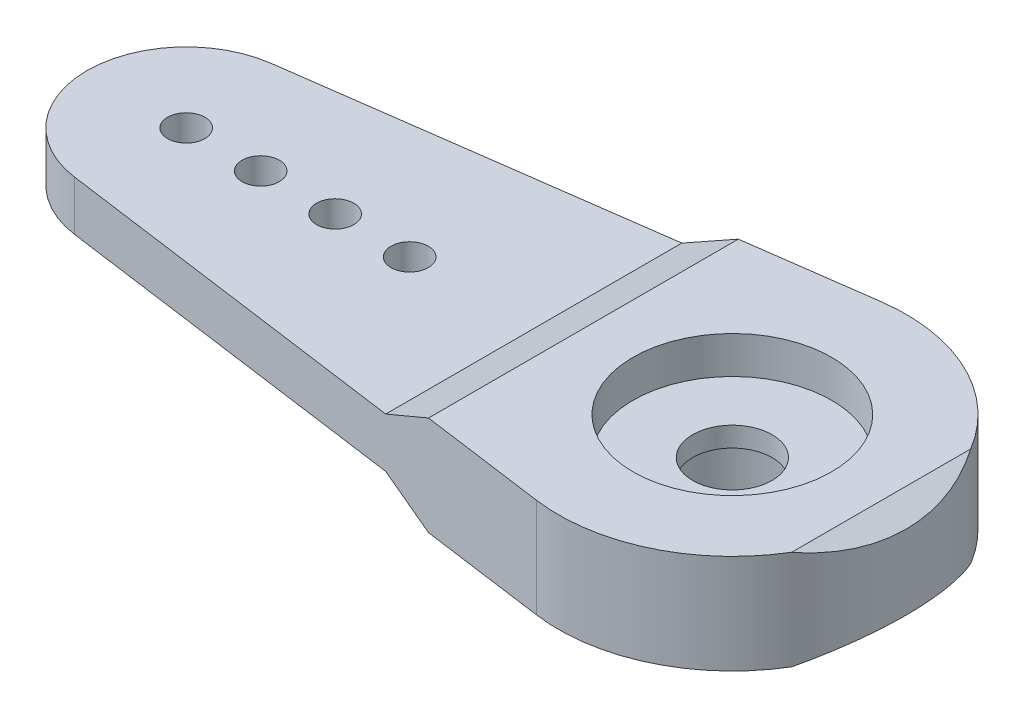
ISO-10303-21;
HEADER;
FILE_DESCRIPTION(('STEP AP214'),'2;1');
FILE_NAME('part.step','',(''),(''),'','','');
FILE_SCHEMA(('AUTOMOTIVE_DESIGN { 1 0 10303 214 1 1 1 1 }'));
ENDSEC;
DATA;
#1=APPLICATION_CONTEXT('core data for automotive mechanical design processes');
#2=APPLICATION_PROTOCOL_DEFINITION('international standard','automotive_design',2000,#1);
#3=PRODUCT_CONTEXT('',#1,'mechanical');
#4=PRODUCT('Part','Part','',(#3));
#5=PRODUCT_RELATED_PRODUCT_CATEGORY('part','',(#4));
#6=PRODUCT_DEFINITION_FORMATION('','',#4);
#7=PRODUCT_DEFINITION_CONTEXT('part definition',#1,'design');
#8=PRODUCT_DEFINITION('design','',#6,#7);
#9=PRODUCT_DEFINITION_SHAPE('','',#8);
#10=(LENGTH_UNIT() NAMED_UNIT(*) SI_UNIT(.MILLI.,.METRE.));
#11=(NAMED_UNIT(*) PLANE_ANGLE_UNIT() SI_UNIT($,.RADIAN.));
#12=(NAMED_UNIT(*) SI_UNIT($,.STERADIAN.) SOLID_ANGLE_UNIT());
#13=UNCERTAINTY_MEASURE_WITH_UNIT(LENGTH_MEASURE(1.E-05),#10,'distance_accuracy_value','');
#14=(GEOMETRIC_REPRESENTATION_CONTEXT(3) GLOBAL_UNCERTAINTY_ASSIGNED_CONTEXT((#13)) GLOBAL_UNIT_ASSIGNED_CONTEXT((#10,
#11,#12)) REPRESENTATION_CONTEXT('',''));
#15=CARTESIAN_POINT('',(0.,0.,0.));
#16=DIRECTION('',(0.,0.,1.));
#17=DIRECTION('',(1.,0.,0.));
#18=AXIS2_PLACEMENT_3D('',#15,#16,#17);
#19=CARTESIAN_POINT('',(-6.,0.,15.));
#20=DIRECTION('',(0.,1.,0.));
#21=DIRECTION('',(0.,0.,1.));
#22=AXIS2_PLACEMENT_3D('',#19,#20,#21);
#23=PLANE('',#22);
#24=DIRECTION('',(-0.990658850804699,0.,0.136363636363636));
#25=VECTOR('',#24,1.);
#26=CARTESIAN_POINT('',(-22.5454545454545,0.,-3.96263540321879));
#27=LINE('',#26,#25);
#28=CARTESIAN_POINT('',(-0.954545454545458,0.,-6.93461195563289));
#29=VERTEX_POINT('',#28);
#30=CARTESIAN_POINT('',(-6.,0.,-6.24010796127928));
#31=VERTEX_POINT('',#30);
#32=EDGE_CURVE('E125',#29,#31,#27,.T.);
#33=ORIENTED_EDGE('',*,*,#32,.F.);
#34=CARTESIAN_POINT('',(0.,0.,0.));
#35=DIRECTION('',(0.,1.,0.));
#36=DIRECTION('',(0.,0.,1.));
#37=AXIS2_PLACEMENT_3D('',#34,#35,#36);
#38=CIRCLE('',#37,7.);
#39=CARTESIAN_POINT('',(6.,0.,-3.60555127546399));
#40=VERTEX_POINT('',#39);
#41=EDGE_CURVE('E111',#40,#29,#38,.T.);
#42=ORIENTED_EDGE('',*,*,#41,.F.);
#43=DIRECTION('',(0.,0.,-1.));
#44=VECTOR('',#43,1.);
#45=CARTESIAN_POINT('',(6.,0.,15.));
#46=LINE('',#45,#44);
#47=CARTESIAN_POINT('',(6.,0.,3.60555127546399));
#48=VERTEX_POINT('',#47);
#49=EDGE_CURVE('E181',#48,#40,#46,.T.);
#50=ORIENTED_EDGE('',*,*,#49,.F.);
#51=CARTESIAN_POINT('',(-0.954545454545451,0.,6.93461195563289));
#52=VERTEX_POINT('',#51);
#53=EDGE_CURVE('E51',#52,#48,#38,.T.);
#54=ORIENTED_EDGE('',*,*,#53,.F.);
#55=DIRECTION('',(0.990658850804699,0.,0.136363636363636));
#56=VECTOR('',#55,1.);
#57=CARTESIAN_POINT('',(-0.954545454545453,0.,6.93461195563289));
#58=LINE('',#57,#56);
#59=CARTESIAN_POINT('',(-6.,0.,6.24010796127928));
#60=VERTEX_POINT('',#59);
#61=EDGE_CURVE('E121',#60,#52,#58,.T.);
#62=ORIENTED_EDGE('',*,*,#61,.F.);
#63=DIRECTION('',(0.,0.,-1.));
#64=VECTOR('',#63,1.);
#65=CARTESIAN_POINT('',(-6.,0.,15.));
#66=LINE('',#65,#64);
#67=EDGE_CURVE('E137',#60,#31,#66,.T.);
#68=ORIENTED_EDGE('',*,*,#67,.T.);
#69=EDGE_LOOP('',(#33,#42,#50,#54,#62,#68));
#70=FACE_BOUND('',#69,.T.);
#71=CARTESIAN_POINT('',(0.,0.,0.));
#72=DIRECTION('',(0.,1.,0.));
#73=DIRECTION('',(0.,0.,1.));
#74=AXIS2_PLACEMENT_3D('',#71,#72,#73);
#75=CIRCLE('',#74,5.);
#76=CARTESIAN_POINT('',(0.,0.,5.00000000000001));
#77=VERTEX_POINT('',#76);
#78=EDGE_CURVE('E11',#77,#77,#75,.F.);
#79=ORIENTED_EDGE('',*,*,#78,.F.);
#80=EDGE_LOOP('',(#79));
#81=FACE_BOUND('',#80,.T.);
#82=ADVANCED_FACE('F34',(#70,#81),#23,.F.);
#83=CARTESIAN_POINT('',(-6.,4.,15.));
#84=DIRECTION('',(0.,-1.,0.));
#85=DIRECTION('',(0.,0.,-1.));
#86=AXIS2_PLACEMENT_3D('',#83,#84,#85);
#87=PLANE('',#86);
#88=CARTESIAN_POINT('',(0.,4.,0.));
#89=DIRECTION('',(0.,1.,0.));
#90=DIRECTION('',(0.,0.,1.));
#91=AXIS2_PLACEMENT_3D('',#88,#89,#90);
#92=CIRCLE('',#91,4.);
#93=CARTESIAN_POINT('',(0.,4.,4.));
#94=VERTEX_POINT('',#93);
#95=EDGE_CURVE('E229',#94,#94,#92,.T.);
#96=ORIENTED_EDGE('',*,*,#95,.F.);
#97=EDGE_LOOP('',(#96));
#98=FACE_BOUND('',#97,.T.);
#99=DIRECTION('',(-0.990658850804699,0.,0.136363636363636));
#100=VECTOR('',#99,1.);
#101=CARTESIAN_POINT('',(-22.5454545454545,4.,-3.96263540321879));
#102=LINE('',#101,#100);
#103=CARTESIAN_POINT('',(-0.954545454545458,4.,-6.93461195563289));
#104=VERTEX_POINT('',#103);
#105=CARTESIAN_POINT('',(-6.,4.,-6.24010796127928));
#106=VERTEX_POINT('',#105);
#107=EDGE_CURVE('E128',#104,#106,#102,.T.);
#108=ORIENTED_EDGE('',*,*,#107,.T.);
#109=DIRECTION('',(0.,0.,-1.));
#110=VECTOR('',#109,1.);
#111=CARTESIAN_POINT('',(-6.,4.,15.));
#112=LINE('',#111,#110);
#113=CARTESIAN_POINT('',(-6.,4.,6.24010796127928));
#114=VERTEX_POINT('',#113);
#115=EDGE_CURVE('E175',#114,#106,#112,.T.);
#116=ORIENTED_EDGE('',*,*,#115,.F.);
#117=DIRECTION('',(0.990658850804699,0.,0.136363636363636));
#118=VECTOR('',#117,1.);
#119=CARTESIAN_POINT('',(-0.954545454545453,4.,6.93461195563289));
#120=LINE('',#119,#118);
#121=CARTESIAN_POINT('',(-0.954545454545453,4.,6.93461195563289));
#122=VERTEX_POINT('',#121);
#123=EDGE_CURVE('E144',#114,#122,#120,.T.);
#124=ORIENTED_EDGE('',*,*,#123,.T.);
#125=CARTESIAN_POINT('',(0.,4.,0.));
#126=DIRECTION('',(0.,1.,0.));
#127=DIRECTION('',(0.,0.,1.));
#128=AXIS2_PLACEMENT_3D('',#125,#126,#127);
#129=CIRCLE('',#128,7.);
#130=CARTESIAN_POINT('',(6.,4.,3.60555127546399));
#131=VERTEX_POINT('',#130);
#132=EDGE_CURVE('E57',#122,#131,#129,.T.);
#133=ORIENTED_EDGE('',*,*,#132,.T.);
#134=DIRECTION('',(0.,0.,-1.));
#135=VECTOR('',#134,1.);
#136=CARTESIAN_POINT('',(6.,4.,15.));
#137=LINE('',#136,#135);
#138=CARTESIAN_POINT('',(6.,4.,-3.60555127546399));
#139=VERTEX_POINT('',#138);
#140=EDGE_CURVE('E178',#131,#139,#137,.T.);
#141=ORIENTED_EDGE('',*,*,#140,.T.);
#142=EDGE_CURVE('E147',#139,#104,#129,.T.);
#143=ORIENTED_EDGE('',*,*,#142,.T.);
#144=EDGE_LOOP('',(#108,#116,#124,#133,#141,#143));
#145=FACE_BOUND('',#144,.T.);
#146=ADVANCED_FACE('F255',(#98,#145),#87,.F.);
#147=CARTESIAN_POINT('',(6.,4.,15.));
#148=DIRECTION('',(-0.447213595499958,-0.894427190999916,0.));
#149=DIRECTION('',(0.894427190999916,-0.447213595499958,0.));
#150=AXIS2_PLACEMENT_3D('',#147,#148,#149);
#151=PLANE('',#150);
#152=CARTESIAN_POINT('',(0.,7.,0.));
#153=DIRECTION('',(-0.447213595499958,-0.894427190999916,0.));
#154=DIRECTION('',(-0.894427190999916,0.447213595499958,0.));
#155=AXIS2_PLACEMENT_3D('',#152,#153,#154);
#156=ELLIPSE('',#155,7.82623792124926,7.);
#157=EDGE_CURVE('E162',#139,#131,#156,.T.);
#158=ORIENTED_EDGE('',*,*,#157,.F.);
#159=ORIENTED_EDGE('',*,*,#140,.F.);
#160=EDGE_LOOP('',(#158,#159));
#161=FACE_BOUND('',#160,.T.);
#162=ADVANCED_FACE('F259',(#161),#151,.F.);
#163=CARTESIAN_POINT('',(-30.,3.,15.));
#164=DIRECTION('',(0.,-1.,0.));
#165=DIRECTION('',(0.,0.,-1.));
#166=AXIS2_PLACEMENT_3D('',#163,#164,#165);
#167=PLANE('',#166);
#168=CARTESIAN_POINT('',(-22.,3.,0.));
#169=DIRECTION('',(0.,1.,0.));
#170=DIRECTION('',(0.,0.,1.));
#171=AXIS2_PLACEMENT_3D('',#168,#169,#170);
#172=CIRCLE('',#171,0.750000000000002);
#173=CARTESIAN_POINT('',(-22.,3.,0.750000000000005));
#174=VERTEX_POINT('',#173);
#175=EDGE_CURVE('E205',#174,#174,#172,.T.);
#176=ORIENTED_EDGE('',*,*,#175,.F.);
#177=EDGE_LOOP('',(#176));
#178=FACE_BOUND('',#177,.T.);
#179=CARTESIAN_POINT('',(-19.,3.,0.));
#180=DIRECTION('',(0.,1.,0.));
#181=DIRECTION('',(0.,0.,1.));
#182=AXIS2_PLACEMENT_3D('',#179,#180,#181);
#183=CIRCLE('',#182,0.750000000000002);
#184=CARTESIAN_POINT('',(-19.,3.,0.750000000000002));
#185=VERTEX_POINT('',#184);
#186=EDGE_CURVE('E202',#185,#185,#183,.T.);
#187=ORIENTED_EDGE('',*,*,#186,.F.);
#188=EDGE_LOOP('',(#187));
#189=FACE_BOUND('',#188,.T.);
#190=CARTESIAN_POINT('',(-16.,3.,0.));
#191=DIRECTION('',(0.,1.,0.));
#192=DIRECTION('',(0.,0.,1.));
#193=AXIS2_PLACEMENT_3D('',#190,#191,#192);
#194=CIRCLE('',#193,0.750000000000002);
#195=CARTESIAN_POINT('',(-16.,3.,0.750000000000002));
#196=VERTEX_POINT('',#195);
#197=EDGE_CURVE('E199',#196,#196,#194,.T.);
#198=ORIENTED_EDGE('',*,*,#197,.F.);
#199=EDGE_LOOP('',(#198));
#200=FACE_BOUND('',#199,.T.);
#201=CARTESIAN_POINT('',(-13.,3.,0.));
#202=DIRECTION('',(0.,1.,0.));
#203=DIRECTION('',(0.,0.,1.));
#204=AXIS2_PLACEMENT_3D('',#201,#202,#203);
#205=CIRCLE('',#204,0.75);
#206=CARTESIAN_POINT('',(-13.,3.,0.75));
#207=VERTEX_POINT('',#206);
#208=EDGE_CURVE('E195',#207,#207,#205,.T.);
#209=ORIENTED_EDGE('',*,*,#208,.F.);
#210=EDGE_LOOP('',(#209));
#211=FACE_BOUND('',#210,.T.);
#212=DIRECTION('',(0.990658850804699,0.,-0.136363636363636));
#213=VECTOR('',#212,1.);
#214=CARTESIAN_POINT('',(-32.4230418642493,3.,-2.60299103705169));
#215=LINE('',#214,#213);
#216=CARTESIAN_POINT('',(-22.5454545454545,3.,-3.96263540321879));
#217=VERTEX_POINT('',#216);
#218=CARTESIAN_POINT('',(-8.,3.,-5.9648090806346));
#219=VERTEX_POINT('',#218);
#220=EDGE_CURVE('E169',#217,#219,#215,.T.);
#221=ORIENTED_EDGE('',*,*,#220,.F.);
#222=CARTESIAN_POINT('',(-22.,3.,0.));
#223=DIRECTION('',(0.,-1.,0.));
#224=DIRECTION('',(0.,0.,-1.));
#225=AXIS2_PLACEMENT_3D('',#222,#223,#224);
#226=CIRCLE('',#225,4.);
#227=CARTESIAN_POINT('',(-22.5454545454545,3.,3.9626354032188));
#228=VERTEX_POINT('',#227);
#229=EDGE_CURVE('E173',#228,#217,#226,.T.);
#230=ORIENTED_EDGE('',*,*,#229,.F.);
#231=DIRECTION('',(-0.990658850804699,0.,-0.136363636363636));
#232=VECTOR('',#231,1.);
#233=CARTESIAN_POINT('',(-28.3703465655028,3.,3.16084227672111));
#234=LINE('',#233,#232);
#235=CARTESIAN_POINT('',(-8.,3.,5.96480908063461));
#236=VERTEX_POINT('',#235);
#237=EDGE_CURVE('E158',#236,#228,#234,.T.);
#238=ORIENTED_EDGE('',*,*,#237,.F.);
#239=DIRECTION('',(0.,0.,-1.));
#240=VECTOR('',#239,1.);
#241=CARTESIAN_POINT('',(-8.,3.,15.));
#242=LINE('',#241,#240);
#243=EDGE_CURVE('E187',#236,#219,#242,.T.);
#244=ORIENTED_EDGE('',*,*,#243,.T.);
#245=EDGE_LOOP('',(#221,#230,#238,#244));
#246=FACE_BOUND('',#245,.T.);
#247=ADVANCED_FACE('F264',(#178,#189,#200,#211,#246),#167,.F.);
#248=CARTESIAN_POINT('',(-8.,3.,15.));
#249=DIRECTION('',(0.447213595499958,-0.894427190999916,0.));
#250=DIRECTION('',(0.894427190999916,0.447213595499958,0.));
#251=AXIS2_PLACEMENT_3D('',#248,#249,#250);
#252=PLANE('',#251);
#253=DIRECTION('',(0.88772447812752,0.44386223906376,-0.122194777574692));
#254=VECTOR('',#253,1.);
#255=CARTESIAN_POINT('',(-10.2741638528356,1.86291807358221,-5.65177169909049));
#256=LINE('',#255,#254);
#257=EDGE_CURVE('E171',#219,#106,#256,.T.);
#258=ORIENTED_EDGE('',*,*,#257,.F.);
#259=ORIENTED_EDGE('',*,*,#243,.F.);
#260=DIRECTION('',(-0.88772447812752,-0.44386223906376,-0.122194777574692));
#261=VECTOR('',#260,1.);
#262=CARTESIAN_POINT('',(-7.01990499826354,3.49004750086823,6.09971860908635));
#263=LINE('',#262,#261);
#264=EDGE_CURVE('E160',#114,#236,#263,.T.);
#265=ORIENTED_EDGE('',*,*,#264,.F.);
#266=ORIENTED_EDGE('',*,*,#115,.T.);
#267=EDGE_LOOP('',(#258,#259,#265,#266));
#268=FACE_BOUND('',#267,.T.);
#269=ADVANCED_FACE('F36',(#268),#252,.F.);
#270=CARTESIAN_POINT('',(-22.,0.,0.));
#271=DIRECTION('',(0.,1.,0.));
#272=DIRECTION('',(0.,0.,1.));
#273=AXIS2_PLACEMENT_3D('',#270,#271,#272);
#274=CYLINDRICAL_SURFACE('',#273,4.);
#275=ORIENTED_EDGE('',*,*,#229,.T.);
#276=DIRECTION('',(0.,1.,0.));
#277=VECTOR('',#276,1.);
#278=CARTESIAN_POINT('',(-22.5454545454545,0.,-3.96263540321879));
#279=LINE('',#278,#277);
#280=CARTESIAN_POINT('',(-22.5454545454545,1.,-3.96263540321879));
#281=VERTEX_POINT('',#280);
#282=EDGE_CURVE('E130',#281,#217,#279,.T.);
#283=ORIENTED_EDGE('',*,*,#282,.F.);
#284=CARTESIAN_POINT('',(-22.,1.,0.));
#285=DIRECTION('',(0.,1.,0.));
#286=DIRECTION('',(0.,0.,1.));
#287=AXIS2_PLACEMENT_3D('',#284,#285,#286);
#288=CIRCLE('',#287,4.);
#289=CARTESIAN_POINT('',(-22.5454545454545,1.,3.9626354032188));
#290=VERTEX_POINT('',#289);
#291=EDGE_CURVE('E43',#281,#290,#288,.T.);
#292=ORIENTED_EDGE('',*,*,#291,.T.);
#293=DIRECTION('',(0.,1.,0.));
#294=VECTOR('',#293,1.);
#295=CARTESIAN_POINT('',(-22.5454545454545,0.,3.9626354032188));
#296=LINE('',#295,#294);
#297=EDGE_CURVE('E138',#290,#228,#296,.T.);
#298=ORIENTED_EDGE('',*,*,#297,.T.);
#299=EDGE_LOOP('',(#275,#283,#292,#298));
#300=FACE_BOUND('',#299,.T.);
#301=ADVANCED_FACE('F271',(#300),#274,.T.);
#302=CARTESIAN_POINT('',(-22.5454545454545,0.,-3.96263540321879));
#303=DIRECTION('',(-0.136363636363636,0.,-0.990658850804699));
#304=DIRECTION('',(-0.990658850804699,0.,0.136363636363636));
#305=AXIS2_PLACEMENT_3D('',#302,#303,#304);
#306=PLANE('',#305);
#307=ORIENTED_EDGE('',*,*,#257,.T.);
#308=ORIENTED_EDGE('',*,*,#107,.F.);
#309=DIRECTION('',(0.,1.,0.));
#310=VECTOR('',#309,1.);
#311=CARTESIAN_POINT('',(-0.954545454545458,0.,-6.93461195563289));
#312=LINE('',#311,#310);
#313=EDGE_CURVE('E114',#29,#104,#312,.T.);
#314=ORIENTED_EDGE('',*,*,#313,.F.);
#315=ORIENTED_EDGE('',*,*,#32,.T.);
#316=DIRECTION('',(-0.88772447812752,0.44386223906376,0.122194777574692));
#317=VECTOR('',#316,1.);
#318=CARTESIAN_POINT('',(-8.30402698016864,1.15201349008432,-5.92295993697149));
#319=LINE('',#318,#317);
#320=CARTESIAN_POINT('',(-8.,1.,-5.9648090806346));
#321=VERTEX_POINT('',#320);
#322=EDGE_CURVE('E165',#31,#321,#319,.T.);
#323=ORIENTED_EDGE('',*,*,#322,.T.);
#324=DIRECTION('',(-0.990658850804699,0.,0.136363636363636));
#325=VECTOR('',#324,1.);
#326=CARTESIAN_POINT('',(-32.4230418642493,1.,-2.60299103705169));
#327=LINE('',#326,#325);
#328=EDGE_CURVE('E167',#321,#281,#327,.T.);
#329=ORIENTED_EDGE('',*,*,#328,.T.);
#330=ORIENTED_EDGE('',*,*,#282,.T.);
#331=ORIENTED_EDGE('',*,*,#220,.T.);
#332=EDGE_LOOP('',(#307,#308,#314,#315,#323,#329,#330,#331));
#333=FACE_BOUND('',#332,.T.);
#334=ADVANCED_FACE('F124',(#333),#306,.T.);
#335=CARTESIAN_POINT('',(0.,0.,0.));
#336=DIRECTION('',(0.,1.,0.));
#337=DIRECTION('',(0.,0.,1.));
#338=AXIS2_PLACEMENT_3D('',#335,#336,#337);
#339=CYLINDRICAL_SURFACE('',#338,7.);
#340=CARTESIAN_POINT('',(0.,-3.00000000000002,0.));
#341=DIRECTION('',(-0.44721359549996,0.894427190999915,0.));
#342=DIRECTION('',(0.894427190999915,0.44721359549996,0.));
#343=AXIS2_PLACEMENT_3D('',#340,#341,#342);
#344=ELLIPSE('',#343,7.82623792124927,7.);
#345=EDGE_CURVE('E116',#48,#40,#344,.T.);
#346=ORIENTED_EDGE('',*,*,#345,.T.);
#347=ORIENTED_EDGE('',*,*,#41,.T.);
#348=ORIENTED_EDGE('',*,*,#313,.T.);
#349=ORIENTED_EDGE('',*,*,#142,.F.);
#350=ORIENTED_EDGE('',*,*,#157,.T.);
#351=ORIENTED_EDGE('',*,*,#132,.F.);
#352=DIRECTION('',(0.,1.,0.));
#353=VECTOR('',#352,1.);
#354=CARTESIAN_POINT('',(-0.954545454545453,0.,6.93461195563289));
#355=LINE('',#354,#353);
#356=EDGE_CURVE('E131',#52,#122,#355,.T.);
#357=ORIENTED_EDGE('',*,*,#356,.F.);
#358=ORIENTED_EDGE('',*,*,#53,.T.);
#359=EDGE_LOOP('',(#346,#347,#348,#349,#350,#351,#357,#358));
#360=FACE_BOUND('',#359,.T.);
#361=ADVANCED_FACE('F113',(#360),#339,.T.);
#362=CARTESIAN_POINT('',(-0.954545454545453,0.,6.93461195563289));
#363=DIRECTION('',(-0.136363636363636,0.,0.990658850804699));
#364=DIRECTION('',(0.990658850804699,0.,0.136363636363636));
#365=AXIS2_PLACEMENT_3D('',#362,#363,#364);
#366=PLANE('',#365);
#367=ORIENTED_EDGE('',*,*,#264,.T.);
#368=ORIENTED_EDGE('',*,*,#237,.T.);
#369=ORIENTED_EDGE('',*,*,#297,.F.);
#370=DIRECTION('',(0.990658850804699,0.,0.136363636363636));
#371=VECTOR('',#370,1.);
#372=CARTESIAN_POINT('',(-28.3703465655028,1.,3.16084227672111));
#373=LINE('',#372,#371);
#374=CARTESIAN_POINT('',(-8.,1.,5.96480908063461));
#375=VERTEX_POINT('',#374);
#376=EDGE_CURVE('E156',#290,#375,#373,.T.);
#377=ORIENTED_EDGE('',*,*,#376,.T.);
#378=DIRECTION('',(0.88772447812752,-0.44386223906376,0.122194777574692));
#379=VECTOR('',#378,1.);
#380=CARTESIAN_POINT('',(-5.0497681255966,-0.475115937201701,6.37090684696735));
#381=LINE('',#380,#379);
#382=EDGE_CURVE('E152',#375,#60,#381,.T.);
#383=ORIENTED_EDGE('',*,*,#382,.T.);
#384=ORIENTED_EDGE('',*,*,#61,.T.);
#385=ORIENTED_EDGE('',*,*,#356,.T.);
#386=ORIENTED_EDGE('',*,*,#123,.F.);
#387=EDGE_LOOP('',(#367,#368,#369,#377,#383,#384,#385,#386));
#388=FACE_BOUND('',#387,.T.);
#389=ADVANCED_FACE('F234',(#388),#366,.T.);
#390=CARTESIAN_POINT('',(-30.,1.,15.));
#391=DIRECTION('',(0.,1.,0.));
#392=DIRECTION('',(0.,0.,1.));
#393=AXIS2_PLACEMENT_3D('',#390,#391,#392);
#394=PLANE('',#393);
#395=CARTESIAN_POINT('',(-22.,1.,0.));
#396=DIRECTION('',(0.,1.,0.));
#397=DIRECTION('',(0.,0.,1.));
#398=AXIS2_PLACEMENT_3D('',#395,#396,#397);
#399=CIRCLE('',#398,0.750000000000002);
#400=CARTESIAN_POINT('',(-22.,1.,0.750000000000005));
#401=VERTEX_POINT('',#400);
#402=EDGE_CURVE('E203',#401,#401,#399,.T.);
#403=ORIENTED_EDGE('',*,*,#402,.T.);
#404=EDGE_LOOP('',(#403));
#405=FACE_BOUND('',#404,.T.);
#406=CARTESIAN_POINT('',(-19.,1.,0.));
#407=DIRECTION('',(0.,1.,0.));
#408=DIRECTION('',(0.,0.,1.));
#409=AXIS2_PLACEMENT_3D('',#406,#407,#408);
#410=CIRCLE('',#409,0.750000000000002);
#411=CARTESIAN_POINT('',(-19.,1.,0.750000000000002));
#412=VERTEX_POINT('',#411);
#413=EDGE_CURVE('E200',#412,#412,#410,.T.);
#414=ORIENTED_EDGE('',*,*,#413,.T.);
#415=EDGE_LOOP('',(#414));
#416=FACE_BOUND('',#415,.T.);
#417=CARTESIAN_POINT('',(-16.,1.,0.));
#418=DIRECTION('',(0.,1.,0.));
#419=DIRECTION('',(0.,0.,1.));
#420=AXIS2_PLACEMENT_3D('',#417,#418,#419);
#421=CIRCLE('',#420,0.750000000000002);
#422=CARTESIAN_POINT('',(-16.,1.,0.750000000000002));
#423=VERTEX_POINT('',#422);
#424=EDGE_CURVE('E196',#423,#423,#421,.T.);
#425=ORIENTED_EDGE('',*,*,#424,.T.);
#426=EDGE_LOOP('',(#425));
#427=FACE_BOUND('',#426,.T.);
#428=CARTESIAN_POINT('',(-13.,1.,0.));
#429=DIRECTION('',(0.,1.,0.));
#430=DIRECTION('',(0.,0.,1.));
#431=AXIS2_PLACEMENT_3D('',#428,#429,#430);
#432=CIRCLE('',#431,0.75);
#433=CARTESIAN_POINT('',(-13.,1.,0.75));
#434=VERTEX_POINT('',#433);
#435=EDGE_CURVE('E191',#434,#434,#432,.T.);
#436=ORIENTED_EDGE('',*,*,#435,.T.);
#437=EDGE_LOOP('',(#436));
#438=FACE_BOUND('',#437,.T.);
#439=ORIENTED_EDGE('',*,*,#328,.F.);
#440=DIRECTION('',(0.,0.,-1.));
#441=VECTOR('',#440,1.);
#442=CARTESIAN_POINT('',(-8.,1.,15.));
#443=LINE('',#442,#441);
#444=EDGE_CURVE('E184',#375,#321,#443,.T.);
#445=ORIENTED_EDGE('',*,*,#444,.F.);
#446=ORIENTED_EDGE('',*,*,#376,.F.);
#447=ORIENTED_EDGE('',*,*,#291,.F.);
#448=EDGE_LOOP('',(#439,#445,#446,#447));
#449=FACE_BOUND('',#448,.T.);
#450=ADVANCED_FACE('F249',(#405,#416,#427,#438,#449),#394,.F.);
#451=CARTESIAN_POINT('',(-6.,0.,15.));
#452=DIRECTION('',(0.447213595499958,0.894427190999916,0.));
#453=DIRECTION('',(-0.894427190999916,0.447213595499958,0.));
#454=AXIS2_PLACEMENT_3D('',#451,#452,#453);
#455=PLANE('',#454);
#456=ORIENTED_EDGE('',*,*,#322,.F.);
#457=ORIENTED_EDGE('',*,*,#67,.F.);
#458=ORIENTED_EDGE('',*,*,#382,.F.);
#459=ORIENTED_EDGE('',*,*,#444,.T.);
#460=EDGE_LOOP('',(#456,#457,#458,#459));
#461=FACE_BOUND('',#460,.T.);
#462=ADVANCED_FACE('F240',(#461),#455,.F.);
#463=CARTESIAN_POINT('',(8.,1.,15.));
#464=DIRECTION('',(-0.44721359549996,0.894427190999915,0.));
#465=DIRECTION('',(-0.894427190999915,-0.44721359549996,0.));
#466=AXIS2_PLACEMENT_3D('',#463,#464,#465);
#467=PLANE('',#466);
#468=ORIENTED_EDGE('',*,*,#345,.F.);
#469=ORIENTED_EDGE('',*,*,#49,.T.);
#470=EDGE_LOOP('',(#468,#469));
#471=FACE_BOUND('',#470,.T.);
#472=ADVANCED_FACE('F237',(#471),#467,.F.);
#473=CARTESIAN_POINT('',(0.,2.5,0.));
#474=DIRECTION('',(0.,1.,0.));
#475=DIRECTION('',(0.,0.,1.));
#476=AXIS2_PLACEMENT_3D('',#473,#474,#475);
#477=CYLINDRICAL_SURFACE('',#476,4.);
#478=CARTESIAN_POINT('',(0.,2.5,0.));
#479=DIRECTION('',(0.,1.,0.));
#480=DIRECTION('',(0.,0.,1.));
#481=AXIS2_PLACEMENT_3D('',#478,#479,#480);
#482=CIRCLE('',#481,4.);
#483=CARTESIAN_POINT('',(0.,2.5,4.));
#484=VERTEX_POINT('',#483);
#485=EDGE_CURVE('E148',#484,#484,#482,.T.);
#486=ORIENTED_EDGE('',*,*,#485,.F.);
#487=EDGE_LOOP('',(#486));
#488=FACE_BOUND('',#487,.T.);
#489=ORIENTED_EDGE('',*,*,#95,.T.);
#490=EDGE_LOOP('',(#489));
#491=FACE_BOUND('',#490,.T.);
#492=ADVANCED_FACE('F239',(#488,#491),#477,.F.);
#493=CARTESIAN_POINT('',(0.,2.5,0.));
#494=DIRECTION('',(0.,1.,0.));
#495=DIRECTION('',(0.,0.,1.));
#496=AXIS2_PLACEMENT_3D('',#493,#494,#495);
#497=PLANE('',#496);
#498=CARTESIAN_POINT('',(0.,2.5,0.));
#499=DIRECTION('',(0.,1.,0.));
#500=DIRECTION('',(0.,0.,1.));
#501=AXIS2_PLACEMENT_3D('',#498,#499,#500);
#502=CIRCLE('',#501,1.6);
#503=CARTESIAN_POINT('',(0.,2.5,1.6));
#504=VERTEX_POINT('',#503);
#505=EDGE_CURVE('E358',#504,#504,#502,.T.);
#506=ORIENTED_EDGE('',*,*,#505,.F.);
#507=EDGE_LOOP('',(#506));
#508=FACE_BOUND('',#507,.T.);
#509=ORIENTED_EDGE('',*,*,#485,.T.);
#510=EDGE_LOOP('',(#509));
#511=FACE_BOUND('',#510,.T.);
#512=ADVANCED_FACE('F246',(#508,#511),#497,.T.);
#513=CARTESIAN_POINT('',(0.,-0.5,0.));
#514=DIRECTION('',(0.,1.,0.));
#515=DIRECTION('',(0.,0.,1.));
#516=AXIS2_PLACEMENT_3D('',#513,#514,#515);
#517=CYLINDRICAL_SURFACE('',#516,5.);
#518=CARTESIAN_POINT('',(0.,-0.5,0.));
#519=DIRECTION('',(0.,-1.,0.));
#520=DIRECTION('',(0.,0.,-1.));
#521=AXIS2_PLACEMENT_3D('',#518,#519,#520);
#522=CIRCLE('',#521,5.);
#523=CARTESIAN_POINT('',(0.,-0.5,-5.));
#524=VERTEX_POINT('',#523);
#525=EDGE_CURVE('E226',#524,#524,#522,.T.);
#526=ORIENTED_EDGE('',*,*,#525,.F.);
#527=EDGE_LOOP('',(#526));
#528=FACE_BOUND('',#527,.T.);
#529=ORIENTED_EDGE('',*,*,#78,.T.);
#530=EDGE_LOOP('',(#529));
#531=FACE_BOUND('',#530,.T.);
#532=ADVANCED_FACE('F312',(#528,#531),#517,.T.);
#533=CARTESIAN_POINT('',(0.,-0.5,0.));
#534=DIRECTION('',(0.,1.,0.));
#535=DIRECTION('',(0.,0.,-1.));
#536=AXIS2_PLACEMENT_3D('',#533,#534,#535);
#537=CONICAL_SURFACE('',#536,5.,0.78539816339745);
#538=CARTESIAN_POINT('',(0.,-2.,0.));
#539=DIRECTION('',(0.,-1.,0.));
#540=DIRECTION('',(0.,0.,-1.));
#541=AXIS2_PLACEMENT_3D('',#538,#539,#540);
#542=CIRCLE('',#541,3.5);
#543=CARTESIAN_POINT('',(0.,-2.,-3.49999999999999));
#544=VERTEX_POINT('',#543);
#545=EDGE_CURVE('E194',#544,#544,#542,.T.);
#546=ORIENTED_EDGE('',*,*,#545,.F.);
#547=EDGE_LOOP('',(#546));
#548=FACE_BOUND('',#547,.T.);
#549=ORIENTED_EDGE('',*,*,#525,.T.);
#550=EDGE_LOOP('',(#549));
#551=FACE_BOUND('',#550,.T.);
#552=ADVANCED_FACE('F316',(#548,#551),#537,.T.);
#553=CARTESIAN_POINT('',(0.,-2.,0.));
#554=DIRECTION('',(0.,-1.,0.));
#555=DIRECTION('',(0.,0.,-1.));
#556=AXIS2_PLACEMENT_3D('',#553,#554,#555);
#557=PLANE('',#556);
#558=CARTESIAN_POINT('',(0.,-2.,0.));
#559=DIRECTION('',(0.,-1.,0.));
#560=DIRECTION('',(0.,0.,-1.));
#561=AXIS2_PLACEMENT_3D('',#558,#559,#560);
#562=CIRCLE('',#561,2.9);
#563=CARTESIAN_POINT('',(0.,-2.,-2.9));
#564=VERTEX_POINT('',#563);
#565=EDGE_CURVE('E216',#564,#564,#562,.T.);
#566=ORIENTED_EDGE('',*,*,#565,.F.);
#567=EDGE_LOOP('',(#566));
#568=FACE_BOUND('',#567,.T.);
#569=ORIENTED_EDGE('',*,*,#545,.T.);
#570=EDGE_LOOP('',(#569));
#571=FACE_BOUND('',#570,.T.);
#572=ADVANCED_FACE('F320',(#568,#571),#557,.T.);
#573=CARTESIAN_POINT('',(-13.,-2.,0.));
#574=DIRECTION('',(0.,1.,0.));
#575=DIRECTION('',(0.,0.,1.));
#576=AXIS2_PLACEMENT_3D('',#573,#574,#575);
#577=CYLINDRICAL_SURFACE('',#576,0.75);
#578=ORIENTED_EDGE('',*,*,#208,.T.);
#579=EDGE_LOOP('',(#578));
#580=FACE_BOUND('',#579,.T.);
#581=ORIENTED_EDGE('',*,*,#435,.F.);
#582=EDGE_LOOP('',(#581));
#583=FACE_BOUND('',#582,.T.);
#584=ADVANCED_FACE('F324',(#580,#583),#577,.F.);
#585=CARTESIAN_POINT('',(-16.,-2.,0.));
#586=DIRECTION('',(0.,1.,0.));
#587=DIRECTION('',(0.,0.,1.));
#588=AXIS2_PLACEMENT_3D('',#585,#586,#587);
#589=CYLINDRICAL_SURFACE('',#588,0.750000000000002);
#590=ORIENTED_EDGE('',*,*,#197,.T.);
#591=EDGE_LOOP('',(#590));
#592=FACE_BOUND('',#591,.T.);
#593=ORIENTED_EDGE('',*,*,#424,.F.);
#594=EDGE_LOOP('',(#593));
#595=FACE_BOUND('',#594,.T.);
#596=ADVANCED_FACE('F328',(#592,#595),#589,.F.);
#597=CARTESIAN_POINT('',(-19.,-2.,0.));
#598=DIRECTION('',(0.,1.,0.));
#599=DIRECTION('',(0.,0.,1.));
#600=AXIS2_PLACEMENT_3D('',#597,#598,#599);
#601=CYLINDRICAL_SURFACE('',#600,0.750000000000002);
#602=ORIENTED_EDGE('',*,*,#186,.T.);
#603=EDGE_LOOP('',(#602));
#604=FACE_BOUND('',#603,.T.);
#605=ORIENTED_EDGE('',*,*,#413,.F.);
#606=EDGE_LOOP('',(#605));
#607=FACE_BOUND('',#606,.T.);
#608=ADVANCED_FACE('F332',(#604,#607),#601,.F.);
#609=CARTESIAN_POINT('',(-22.,-2.,0.));
#610=DIRECTION('',(0.,1.,0.));
#611=DIRECTION('',(0.,0.,1.));
#612=AXIS2_PLACEMENT_3D('',#609,#610,#611);
#613=CYLINDRICAL_SURFACE('',#612,0.750000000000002);
#614=ORIENTED_EDGE('',*,*,#175,.T.);
#615=EDGE_LOOP('',(#614));
#616=FACE_BOUND('',#615,.T.);
#617=ORIENTED_EDGE('',*,*,#402,.F.);
#618=EDGE_LOOP('',(#617));
#619=FACE_BOUND('',#618,.T.);
#620=ADVANCED_FACE('F336',(#616,#619),#613,.F.);
#621=CARTESIAN_POINT('',(0.,1.7,0.));
#622=DIRECTION('',(0.,-1.,0.));
#623=DIRECTION('',(0.,0.,-1.));
#624=AXIS2_PLACEMENT_3D('',#621,#622,#623);
#625=CYLINDRICAL_SURFACE('',#624,2.9);
#626=CARTESIAN_POINT('',(0.,1.7,0.));
#627=DIRECTION('',(0.,-1.,0.));
#628=DIRECTION('',(0.,0.,-1.));
#629=AXIS2_PLACEMENT_3D('',#626,#627,#628);
#630=CIRCLE('',#629,2.9);
#631=CARTESIAN_POINT('',(0.,1.7,-2.9));
#632=VERTEX_POINT('',#631);
#633=EDGE_CURVE('E211',#632,#632,#630,.T.);
#634=ORIENTED_EDGE('',*,*,#633,.F.);
#635=EDGE_LOOP('',(#634));
#636=FACE_BOUND('',#635,.T.);
#637=ORIENTED_EDGE('',*,*,#565,.T.);
#638=EDGE_LOOP('',(#637));
#639=FACE_BOUND('',#638,.T.);
#640=ADVANCED_FACE('F340',(#636,#639),#625,.F.);
#641=CARTESIAN_POINT('',(0.,1.7,0.));
#642=DIRECTION('',(0.,-1.,0.));
#643=DIRECTION('',(0.,0.,-1.));
#644=AXIS2_PLACEMENT_3D('',#641,#642,#643);
#645=PLANE('',#644);
#646=CARTESIAN_POINT('',(0.,1.7,0.));
#647=DIRECTION('',(0.,-1.,0.));
#648=DIRECTION('',(0.,0.,-1.));
#649=AXIS2_PLACEMENT_3D('',#646,#647,#648);
#650=CIRCLE('',#649,1.6);
#651=CARTESIAN_POINT('',(0.,1.7,-1.6));
#652=VERTEX_POINT('',#651);
#653=EDGE_CURVE('E38',#652,#652,#650,.T.);
#654=ORIENTED_EDGE('',*,*,#653,.F.);
#655=EDGE_LOOP('',(#654));
#656=FACE_BOUND('',#655,.T.);
#657=ORIENTED_EDGE('',*,*,#633,.T.);
#658=EDGE_LOOP('',(#657));
#659=FACE_BOUND('',#658,.T.);
#660=ADVANCED_FACE('F343',(#656,#659),#645,.T.);
#661=CARTESIAN_POINT('',(0.,-2.,0.));
#662=DIRECTION('',(0.,1.,0.));
#663=DIRECTION('',(0.,0.,1.));
#664=AXIS2_PLACEMENT_3D('',#661,#662,#663);
#665=CYLINDRICAL_SURFACE('',#664,1.6);
#666=ORIENTED_EDGE('',*,*,#653,.T.);
#667=EDGE_LOOP('',(#666));
#668=FACE_BOUND('',#667,.T.);
#669=ORIENTED_EDGE('',*,*,#505,.T.);
#670=EDGE_LOOP('',(#669));
#671=FACE_BOUND('',#670,.T.);
#672=ADVANCED_FACE('F347',(#668,#671),#665,.F.);
#673=CLOSED_SHELL('',(#82,#146,#162,#247,#269,#301,#334,#361,#389,#450,#462,#472,#492,#512,#532,
#552,#572,#584,#596,#608,#620,#640,#660,#672));
#674=MANIFOLD_SOLID_BREP('B2',#673);
#675=ADVANCED_BREP_SHAPE_REPRESENTATION('',(#18,#674),#14);
#676=SHAPE_DEFINITION_REPRESENTATION(#9,#675);
ENDSEC;
END-ISO-10303-21;
